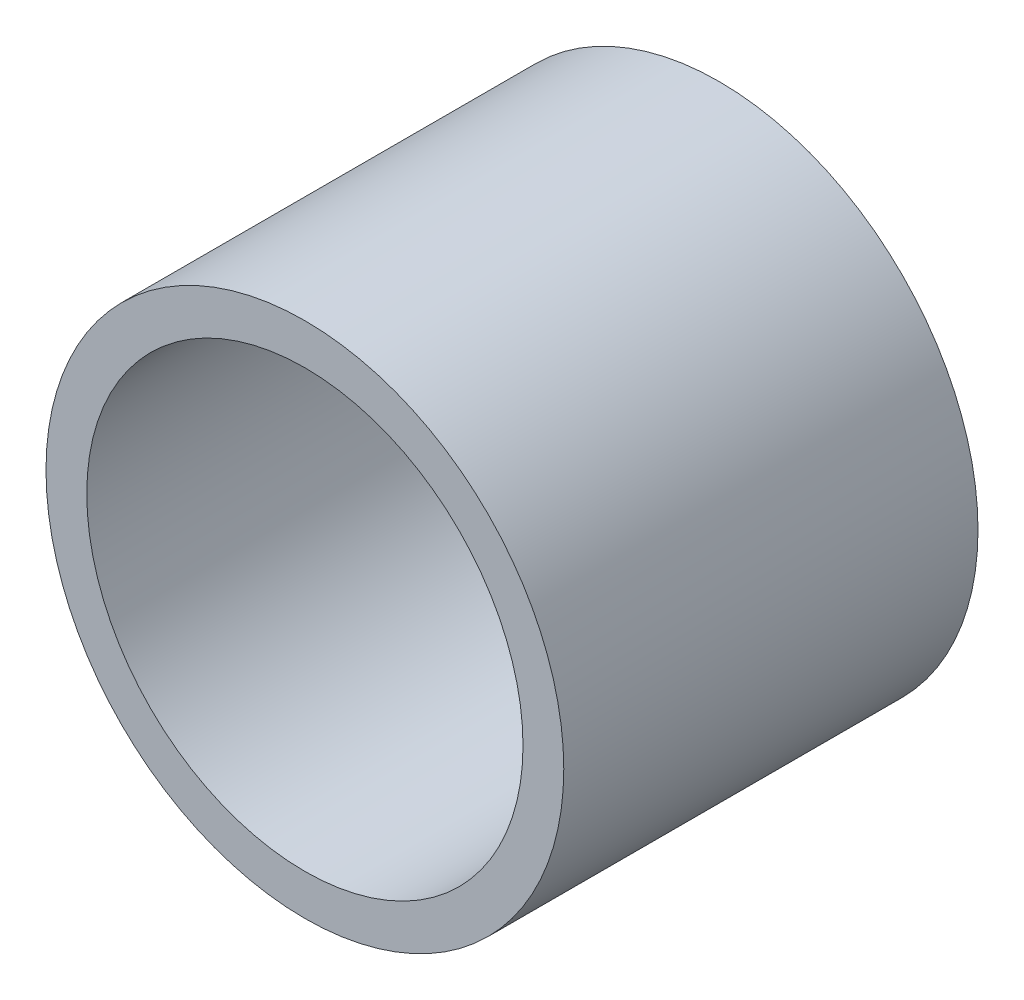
from build123d import *

# Parameters (mm, degrees)
SKETCH1_R           = 15.875
SKETCH1_R_2         = 13.375
EXTRUDE_THIN1_DEPTH = 25.4


with BuildPart() as part:
    # Sketch1 → Extrude-Thin1 (new body)
    with BuildSketch(Plane.XY):
        Circle(SKETCH1_R)
        Circle(SKETCH1_R_2, mode=Mode.SUBTRACT)
    extrude(amount=EXTRUDE_THIN1_DEPTH)


solid = part.part
